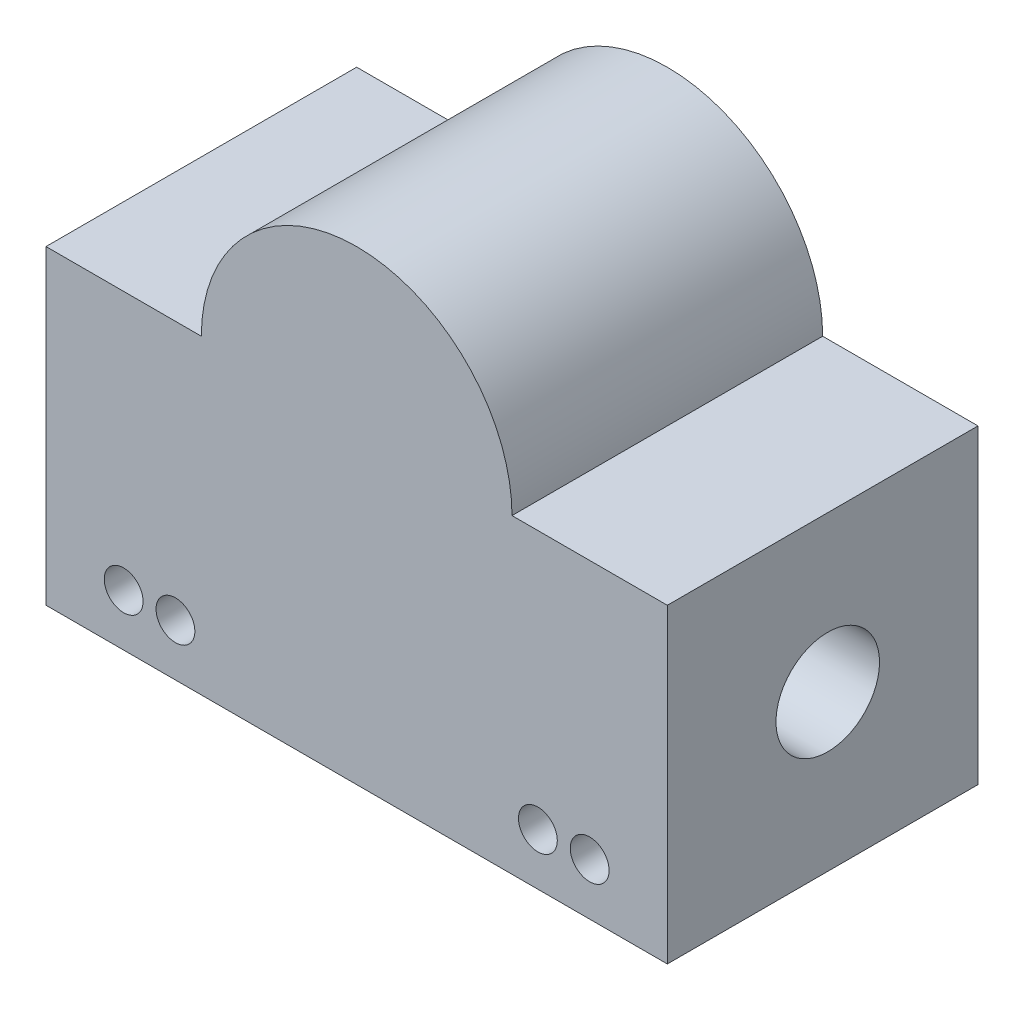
from build123d import *

# Parameters (mm, degrees)
BOSS_EXTRUDE1_DEPTH = 38.1
SKETCH2_R           = 6.35
CUT_EXTRUDE1_DEPTH  = 103.587389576
SKETCH3_R           = 2.38125
CUT_EXTRUDE2_DEPTH  = 103.587389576


with BuildPart() as part:
    # Sketch1 → Boss-Extrude1 (new body)
    with BuildSketch(Plane.XY):
        with BuildLine():
            Line((57.15, 38.1), (76.2, 38.1))
            Line((76.2, 38.1), (76.2, 0))
            Line((76.2, 0), (0, 0))
            Line((0, 0), (0, 38.1))
            Line((0, 38.1), (19.05, 38.1))
            ThreePointArc((19.05, 38.1), (38.1, 57.15), (57.15, 38.1))
        make_face()
    extrude(amount=BOSS_EXTRUDE1_DEPTH)

    # Sketch2 → Cut-Extrude1 (cut, through all)
    with BuildSketch(Plane(origin=(76.2, 0, 0), x_dir=(0, 0, -1), z_dir=(1, 0, 0))):
        with Locations((-18.427327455, 19.05)):
            Circle(SKETCH2_R)
    extrude(amount=-CUT_EXTRUDE1_DEPTH, mode=Mode.SUBTRACT)

    # Sketch3 → Cut-Extrude2 (cut, through all)
    with BuildSketch(Plane.XY.offset(38.1)):
        with Locations((9.525, 6.35)):
            Circle(SKETCH3_R)
        with Locations((15.875, 6.35)):
            Circle(SKETCH3_R)
        with Locations((60.325, 6.35)):
            Circle(SKETCH3_R)
        with Locations((66.675, 6.35)):
            Circle(SKETCH3_R)
    extrude(amount=-CUT_EXTRUDE2_DEPTH, mode=Mode.SUBTRACT)


solid = part.part
